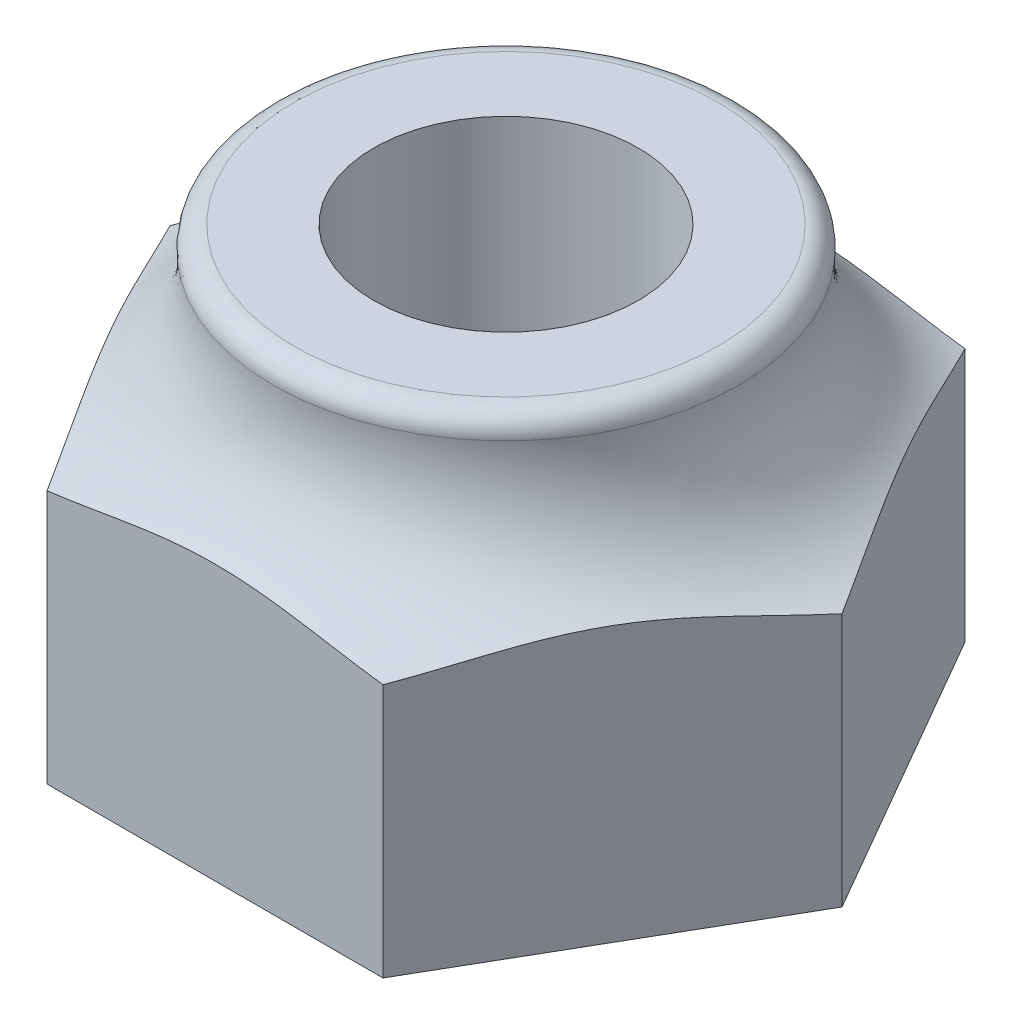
ISO-10303-21;
HEADER;
FILE_DESCRIPTION(('STEP AP214'),'2;1');
FILE_NAME('part.step','',(''),(''),'','','');
FILE_SCHEMA(('AUTOMOTIVE_DESIGN { 1 0 10303 214 1 1 1 1 }'));
ENDSEC;
DATA;
#1=APPLICATION_CONTEXT('core data for automotive mechanical design processes');
#2=APPLICATION_PROTOCOL_DEFINITION('international standard','automotive_design',2000,#1);
#3=PRODUCT_CONTEXT('',#1,'mechanical');
#4=PRODUCT('Part','Part','',(#3));
#5=PRODUCT_RELATED_PRODUCT_CATEGORY('part','',(#4));
#6=PRODUCT_DEFINITION_FORMATION('','',#4);
#7=PRODUCT_DEFINITION_CONTEXT('part definition',#1,'design');
#8=PRODUCT_DEFINITION('design','',#6,#7);
#9=PRODUCT_DEFINITION_SHAPE('','',#8);
#10=(LENGTH_UNIT() NAMED_UNIT(*) SI_UNIT(.MILLI.,.METRE.));
#11=(NAMED_UNIT(*) PLANE_ANGLE_UNIT() SI_UNIT($,.RADIAN.));
#12=(NAMED_UNIT(*) SI_UNIT($,.STERADIAN.) SOLID_ANGLE_UNIT());
#13=UNCERTAINTY_MEASURE_WITH_UNIT(LENGTH_MEASURE(1.E-05),#10,'distance_accuracy_value','');
#14=(GEOMETRIC_REPRESENTATION_CONTEXT(3) GLOBAL_UNCERTAINTY_ASSIGNED_CONTEXT((#13)) GLOBAL_UNIT_ASSIGNED_CONTEXT((#10,
#11,#12)) REPRESENTATION_CONTEXT('',''));
#15=CARTESIAN_POINT('',(0.,0.,0.));
#16=DIRECTION('',(0.,0.,1.));
#17=DIRECTION('',(1.,0.,0.));
#18=AXIS2_PLACEMENT_3D('',#15,#16,#17);
#19=CARTESIAN_POINT('',(3.17542648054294,4.,0.));
#20=DIRECTION('',(-0.866025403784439,0.,0.5));
#21=DIRECTION('',(0.5,0.,0.866025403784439));
#22=AXIS2_PLACEMENT_3D('',#19,#20,#21);
#23=PLANE('',#22);
#24=CARTESIAN_POINT('',(3.17554195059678,2.39997086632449,0.000199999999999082));
#25=CARTESIAN_POINT('',(3.1481533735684,2.40687781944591,-0.0472384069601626));
#26=CARTESIAN_POINT('',(3.12081137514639,2.41445945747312,-0.0945961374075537));
#27=CARTESIAN_POINT('',(3.06620121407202,2.43055422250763,-0.189183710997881));
#28=CARTESIAN_POINT('',(3.03893303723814,2.4390671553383,-0.23641357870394));
#29=CARTESIAN_POINT('',(2.95706841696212,2.4654213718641,-0.378207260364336));
#30=CARTESIAN_POINT('',(2.90253707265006,2.48404263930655,-0.472658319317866));
#31=CARTESIAN_POINT('',(2.79377304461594,2.51959863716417,-0.661043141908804));
#32=CARTESIAN_POINT('',(2.73954140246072,2.53654552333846,-0.754975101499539));
#33=CARTESIAN_POINT('',(2.63076214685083,2.5651452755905,-0.943386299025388));
#34=CARTESIAN_POINT('',(2.57621501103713,2.57680470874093,-1.03786470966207));
#35=CARTESIAN_POINT('',(2.49432193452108,2.58805878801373,-1.17970767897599));
#36=CARTESIAN_POINT('',(2.46708379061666,2.59077194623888,-1.22688552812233));
#37=CARTESIAN_POINT('',(2.41257422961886,2.59397083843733,-1.32129885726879));
#38=CARTESIAN_POINT('',(2.38530281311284,2.59445661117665,-1.3685343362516));
#39=CARTESIAN_POINT('',(2.33076554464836,2.59315671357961,-1.4629956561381));
#40=CARTESIAN_POINT('',(2.30349969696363,2.59137034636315,-1.51022148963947));
#41=CARTESIAN_POINT('',(2.2490226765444,2.58566437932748,-1.60457845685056));
#42=CARTESIAN_POINT('',(2.22181150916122,2.58174458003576,-1.65170958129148));
#43=CARTESIAN_POINT('',(2.14035527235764,2.56718904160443,-1.79279592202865));
#44=CARTESIAN_POINT('',(2.08623774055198,2.55375513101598,-1.88653023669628));
#45=CARTESIAN_POINT('',(1.97832043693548,2.52270727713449,-2.07344848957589));
#46=CARTESIAN_POINT('',(1.92452074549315,2.50509231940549,-2.16663228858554));
#47=CARTESIAN_POINT('',(1.84722603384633,2.4794001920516,-2.30051065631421));
#48=CARTESIAN_POINT('',(1.82371274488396,2.47153338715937,-2.34123686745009));
#49=CARTESIAN_POINT('',(1.77668077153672,2.45599045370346,-2.42269863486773));
#50=CARTESIAN_POINT('',(1.75316209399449,2.44831424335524,-2.46343417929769));
#51=CARTESIAN_POINT('',(1.70600983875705,2.43340582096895,-2.54510428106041));
#52=CARTESIAN_POINT('',(1.68237613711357,2.42617514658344,-2.58603905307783));
#53=CARTESIAN_POINT('',(1.63503905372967,2.41245070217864,-2.66802928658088));
#54=CARTESIAN_POINT('',(1.61133563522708,2.40595744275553,-2.70908481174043));
#55=CARTESIAN_POINT('',(1.58759777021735,2.39997086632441,-2.75020000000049));
#56=B_SPLINE_CURVE_WITH_KNOTS('',3,(#24,#25,#26,#27,#28,#29,#30,#31,#32,#33,#34,#35,#36,#37,#38,
#39,#40,#41,#42,#43,#44,#45,#46,#47,#48,#49,#50,#51,#52,#53,#54,#55),.UNSPECIFIED.,.F.,.F.,(4,2,
2,2,2,2,2,2,2,2,2,2,2,2,2,4),(0.,0.165617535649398,0.331200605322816,0.663125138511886,
0.992428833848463,1.32132240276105,1.48491237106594,1.64849949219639,1.81213679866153,
1.97578940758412,2.30279695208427,2.62988391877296,2.7729244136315,2.91590242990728,
3.05934905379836,3.20289440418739),.UNSPECIFIED.);
#57=CARTESIAN_POINT('',(3.17542648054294,2.4,0.));
#58=VERTEX_POINT('',#57);
#59=CARTESIAN_POINT('',(1.58771324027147,2.4,-2.75));
#60=VERTEX_POINT('',#59);
#61=EDGE_CURVE('E93',#58,#60,#56,.T.);
#62=ORIENTED_EDGE('',*,*,#61,.F.);
#63=DIRECTION('',(0.,-1.,0.));
#64=VECTOR('',#63,1.);
#65=CARTESIAN_POINT('',(3.17542648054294,4.,0.));
#66=LINE('',#65,#64);
#67=CARTESIAN_POINT('',(3.17542648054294,0.,0.));
#68=VERTEX_POINT('',#67);
#69=EDGE_CURVE('E64',#58,#68,#66,.T.);
#70=ORIENTED_EDGE('',*,*,#69,.T.);
#71=DIRECTION('',(-0.5,0.,-0.866025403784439));
#72=VECTOR('',#71,1.);
#73=CARTESIAN_POINT('',(3.17542648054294,0.,0.));
#74=LINE('',#73,#72);
#75=CARTESIAN_POINT('',(1.58771324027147,0.,-2.75));
#76=VERTEX_POINT('',#75);
#77=EDGE_CURVE('E99',#68,#76,#74,.T.);
#78=ORIENTED_EDGE('',*,*,#77,.T.);
#79=DIRECTION('',(0.,-1.,0.));
#80=VECTOR('',#79,1.);
#81=CARTESIAN_POINT('',(1.58771324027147,4.,-2.75));
#82=LINE('',#81,#80);
#83=EDGE_CURVE('E50',#60,#76,#82,.T.);
#84=ORIENTED_EDGE('',*,*,#83,.F.);
#85=EDGE_LOOP('',(#62,#70,#78,#84));
#86=FACE_BOUND('',#85,.T.);
#87=ADVANCED_FACE('F36',(#86),#23,.F.);
#88=CARTESIAN_POINT('',(1.58771324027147,4.,-2.75));
#89=DIRECTION('',(0.,0.,1.));
#90=DIRECTION('',(1.,0.,0.));
#91=AXIS2_PLACEMENT_3D('',#88,#89,#90);
#92=PLANE('',#91);
#93=CARTESIAN_POINT('',(0.,2.59408740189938,-2.75));
#94=CARTESIAN_POINT('',(-0.0541856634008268,2.59408927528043,-2.75));
#95=CARTESIAN_POINT('',(-0.108369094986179,2.59296330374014,-2.75));
#96=CARTESIAN_POINT('',(-0.216649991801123,2.58855378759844,-2.75));
#97=CARTESIAN_POINT('',(-0.270747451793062,2.5852701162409,-2.75));
#98=CARTESIAN_POINT('',(-0.432949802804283,2.5724927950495,-2.75));
#99=CARTESIAN_POINT('',(-0.540820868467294,2.56007380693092,-2.75));
#100=CARTESIAN_POINT('',(-0.757330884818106,2.53033233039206,-2.75));
#101=CARTESIAN_POINT('',(-0.86595997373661,2.51294471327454,-2.75));
#102=CARTESIAN_POINT('',(-1.0829899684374,2.47712238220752,-2.75));
#103=CARTESIAN_POINT('',(-1.19139095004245,2.45868810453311,-2.75));
#104=CARTESIAN_POINT('',(-1.40889170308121,2.42424281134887,-2.75));
#105=CARTESIAN_POINT('',(-1.51799255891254,2.40823822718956,-2.75));
#106=CARTESIAN_POINT('',(-1.73687116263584,2.38198345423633,-2.75));
#107=CARTESIAN_POINT('',(-1.8466484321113,2.37172958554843,-2.75));
#108=CARTESIAN_POINT('',(-2.065610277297,2.36011631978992,-2.75));
#109=CARTESIAN_POINT('',(-2.1747892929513,2.35866630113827,-2.75));
#110=CARTESIAN_POINT('',(-2.3926311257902,2.3673758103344,-2.75));
#111=CARTESIAN_POINT('',(-2.50129449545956,2.37751633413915,-2.75));
#112=CARTESIAN_POINT('',(-2.69556577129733,2.40890052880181,-2.75));
#113=CARTESIAN_POINT('',(-2.78157060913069,2.42761946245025,-2.75));
#114=CARTESIAN_POINT('',(-2.95075321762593,2.47595037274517,-2.75));
#115=CARTESIAN_POINT('',(-3.03392444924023,2.50558589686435,-2.75));
#116=CARTESIAN_POINT('',(-3.19565938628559,2.57722069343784,-2.75));
#117=CARTESIAN_POINT('',(-3.27418094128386,2.6193169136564,-2.75));
#118=CARTESIAN_POINT('',(-3.42275234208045,2.71644658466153,-2.75));
#119=CARTESIAN_POINT('',(-3.49281800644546,2.77145529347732,-2.75));
#120=CARTESIAN_POINT('',(-3.60628167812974,2.8801607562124,-2.75));
#121=CARTESIAN_POINT('',(-3.65212041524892,2.93130972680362,-2.75));
#122=CARTESIAN_POINT('',(-3.73475212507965,3.04050534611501,-2.75));
#123=CARTESIAN_POINT('',(-3.77154785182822,3.09854988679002,-2.75));
#124=CARTESIAN_POINT('',(-3.83446985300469,3.22061417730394,-2.75));
#125=CARTESIAN_POINT('',(-3.86053572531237,3.28466532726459,-2.75));
#126=CARTESIAN_POINT('',(-3.90019844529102,3.41652919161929,-2.75));
#127=CARTESIAN_POINT('',(-3.913801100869,3.48434013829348,-2.75));
#128=CARTESIAN_POINT('',(-3.92702930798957,3.61459455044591,-2.75));
#129=CARTESIAN_POINT('',(-3.92789108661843,3.67691479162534,-2.75));
#130=CARTESIAN_POINT('',(-3.91875902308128,3.80074017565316,-2.75));
#131=CARTESIAN_POINT('',(-3.90876819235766,3.86224553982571,-2.75));
#132=CARTESIAN_POINT('',(-3.87893475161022,3.98071232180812,-2.75));
#133=CARTESIAN_POINT('',(-3.85941539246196,4.03775603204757,-2.75));
#134=CARTESIAN_POINT('',(-3.81157047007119,4.14800818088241,-2.75));
#135=CARTESIAN_POINT('',(-3.78324313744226,4.20121584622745,-2.75));
#136=CARTESIAN_POINT('',(-3.71710182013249,4.30561429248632,-2.75));
#137=CARTESIAN_POINT('',(-3.67884261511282,4.35652171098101,-2.75));
#138=CARTESIAN_POINT('',(-3.59525205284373,4.45209986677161,-2.75));
#139=CARTESIAN_POINT('',(-3.5499199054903,4.49676990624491,-2.75));
#140=CARTESIAN_POINT('',(-3.44728541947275,4.58496870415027,-2.75));
#141=CARTESIAN_POINT('',(-3.38919289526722,4.62757488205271,-2.75));
#142=CARTESIAN_POINT('',(-3.26765241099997,4.70437481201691,-2.75));
#143=CARTESIAN_POINT('',(-3.20419650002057,4.73855576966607,-2.75));
#144=CARTESIAN_POINT('',(-3.03587675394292,4.81618852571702,-2.75));
#145=CARTESIAN_POINT('',(-2.92822827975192,4.85362739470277,-2.75));
#146=CARTESIAN_POINT('',(-2.70869627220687,4.91078934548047,-2.75));
#147=CARTESIAN_POINT('',(-2.5968154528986,4.93052358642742,-2.75));
#148=CARTESIAN_POINT('',(-2.28830937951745,4.96475112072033,-2.75));
#149=CARTESIAN_POINT('',(-2.09014180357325,4.9646011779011,-2.75));
#150=CARTESIAN_POINT('',(-1.7943361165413,4.94452553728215,-2.75));
#151=CARTESIAN_POINT('',(-1.69556674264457,4.93444113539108,-2.75));
#152=CARTESIAN_POINT('',(-1.49842807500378,4.90984125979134,-2.75));
#153=CARTESIAN_POINT('',(-1.40005938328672,4.89532062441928,-2.75));
#154=CARTESIAN_POINT('',(-1.20358450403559,4.86423328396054,-2.75));
#155=CARTESIAN_POINT('',(-1.1054786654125,4.84766460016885,-2.75));
#156=CARTESIAN_POINT('',(-0.909141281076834,4.81509048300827,-2.75));
#157=CARTESIAN_POINT('',(-0.810909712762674,4.79908517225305,-2.75));
#158=CARTESIAN_POINT('',(-0.61440073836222,4.77048072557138,-2.75));
#159=CARTESIAN_POINT('',(-0.516125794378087,4.75786567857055,-2.75));
#160=CARTESIAN_POINT('',(-0.319017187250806,4.73850989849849,-2.75));
#161=CARTESIAN_POINT('',(-0.220183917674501,4.73176544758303,-2.75));
#162=CARTESIAN_POINT('',(-0.0227076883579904,4.72573997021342,-2.75));
#163=CARTESIAN_POINT('',(0.0759341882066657,4.72642615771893,-2.75));
#164=CARTESIAN_POINT('',(0.272920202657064,4.73501520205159,-2.75));
#165=CARTESIAN_POINT('',(0.371264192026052,4.74292120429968,-2.75));
#166=CARTESIAN_POINT('',(0.567780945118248,4.76419403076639,-2.75));
#167=CARTESIAN_POINT('',(0.665950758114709,4.77758621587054,-2.75));
#168=CARTESIAN_POINT('',(0.861841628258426,4.80719567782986,-2.75));
#169=CARTESIAN_POINT('',(0.959562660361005,4.82341311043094,-2.75));
#170=CARTESIAN_POINT('',(1.14230957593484,4.85384849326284,-2.75));
#171=CARTESIAN_POINT('',(1.22733786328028,4.86805291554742,-2.75));
#172=CARTESIAN_POINT('',(1.39752905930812,4.8948511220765,-2.75));
#173=CARTESIAN_POINT('',(1.48269158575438,4.90744724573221,-2.75));
#174=CARTESIAN_POINT('',(1.65353046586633,4.92950158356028,-2.75));
#175=CARTESIAN_POINT('',(1.73920724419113,4.93895668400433,-2.75));
#176=CARTESIAN_POINT('',(1.91097434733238,4.95321465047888,-2.75));
#177=CARTESIAN_POINT('',(1.99706474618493,4.95801664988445,-2.75));
#178=CARTESIAN_POINT('',(2.2187119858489,4.96249991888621,-2.75));
#179=CARTESIAN_POINT('',(2.35442639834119,4.95768753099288,-2.75));
#180=CARTESIAN_POINT('',(2.62381259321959,4.9272464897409,-2.75));
#181=CARTESIAN_POINT('',(2.75748560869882,4.90163095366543,-2.75));
#182=CARTESIAN_POINT('',(2.97395669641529,4.83726104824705,-2.75));
#183=CARTESIAN_POINT('',(3.05888105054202,4.80571621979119,-2.75));
#184=CARTESIAN_POINT('',(3.22278972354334,4.72983919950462,-2.75));
#185=CARTESIAN_POINT('',(3.30178466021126,4.68553058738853,-2.75));
#186=CARTESIAN_POINT('',(3.43780766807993,4.5923127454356,-2.75));
#187=CARTESIAN_POINT('',(3.49627491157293,4.54551376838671,-2.75));
#188=CARTESIAN_POINT('',(3.60477519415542,4.44287767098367,-2.75));
#189=CARTESIAN_POINT('',(3.65480771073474,4.38703999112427,-2.75));
#190=CARTESIAN_POINT('',(3.74434813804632,4.2667273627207,-2.75));
#191=CARTESIAN_POINT('',(3.78377176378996,4.20218902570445,-2.75));
#192=CARTESIAN_POINT('',(3.84917474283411,4.0666152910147,-2.75));
#193=CARTESIAN_POINT('',(3.87516680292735,3.99558610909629,-2.75));
#194=CARTESIAN_POINT('',(3.90942102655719,3.85972932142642,-2.75));
#195=CARTESIAN_POINT('',(3.91962651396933,3.79538796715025,-2.75));
#196=CARTESIAN_POINT('',(3.92816490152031,3.66593155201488,-2.75));
#197=CARTESIAN_POINT('',(3.92650356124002,3.60081688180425,-2.75));
#198=CARTESIAN_POINT('',(3.91196314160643,3.47664152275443,-2.75));
#199=CARTESIAN_POINT('',(3.89990115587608,3.41748273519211,-2.75));
#200=CARTESIAN_POINT('',(3.86623721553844,3.3019617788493,-2.75));
#201=CARTESIAN_POINT('',(3.84463546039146,3.24559955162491,-2.75));
#202=CARTESIAN_POINT('',(3.7922240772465,3.13569820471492,-2.75));
#203=CARTESIAN_POINT('',(3.76120682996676,3.08225867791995,-2.75));
#204=CARTESIAN_POINT('',(3.69144039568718,2.98071829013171,-2.75));
#205=CARTESIAN_POINT('',(3.65268914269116,2.93261886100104,-2.75));
#206=CARTESIAN_POINT('',(3.56445089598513,2.83770151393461,-2.75));
#207=CARTESIAN_POINT('',(3.51426743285,2.79153328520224,-2.75));
#208=CARTESIAN_POINT('',(3.40787608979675,2.70678444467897,-2.75));
#209=CARTESIAN_POINT('',(3.35166382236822,2.66820941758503,-2.75));
#210=CARTESIAN_POINT('',(3.20612889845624,2.58154293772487,-2.75));
#211=CARTESIAN_POINT('',(3.11406781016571,2.53803625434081,-2.75));
#212=CARTESIAN_POINT('',(2.92419415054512,2.46646826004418,-2.75));
#213=CARTESIAN_POINT('',(2.82637394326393,2.4384279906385,-2.75));
#214=CARTESIAN_POINT('',(2.6513851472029,2.40082037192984,-2.75));
#215=CARTESIAN_POINT('',(2.57478656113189,2.38845605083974,-2.75));
#216=CARTESIAN_POINT('',(2.4207593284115,2.37054587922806,-2.75));
#217=CARTESIAN_POINT('',(2.34333010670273,2.3650051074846,-2.75));
#218=CARTESIAN_POINT('',(2.18794990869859,2.35969955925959,-2.75));
#219=CARTESIAN_POINT('',(2.1099981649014,2.35996128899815,-2.75));
#220=CARTESIAN_POINT('',(1.95432683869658,2.36524386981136,-2.75));
#221=CARTESIAN_POINT('',(1.87660713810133,2.37026161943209,-2.75));
#222=CARTESIAN_POINT('',(1.64776801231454,2.39050736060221,-2.75));
#223=CARTESIAN_POINT('',(1.49713594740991,2.41090724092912,-2.75));
#224=CARTESIAN_POINT('',(1.27181345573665,2.44575661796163,-2.75));
#225=CARTESIAN_POINT('',(1.19673208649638,2.45809646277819,-2.75));
#226=CARTESIAN_POINT('',(1.04660466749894,2.4830446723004,-2.75));
#227=CARTESIAN_POINT('',(0.971558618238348,2.49565304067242,-2.75));
#228=CARTESIAN_POINT('',(0.822159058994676,2.51979645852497,-2.75));
#229=CARTESIAN_POINT('',(0.747807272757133,2.53134200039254,-2.75));
#230=CARTESIAN_POINT('',(0.598808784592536,2.55231774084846,-2.75));
#231=CARTESIAN_POINT('',(0.52416214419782,2.56174835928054,-2.75));
#232=CARTESIAN_POINT('',(0.37470775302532,2.57736570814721,-2.75));
#233=CARTESIAN_POINT('',(0.299900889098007,2.58356059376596,-2.75));
#234=CARTESIAN_POINT('',(0.150061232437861,2.59191982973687,-2.75));
#235=CARTESIAN_POINT('',(0.0750284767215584,2.59408480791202,-2.75));
#236=CARTESIAN_POINT('',(0.,2.59408740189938,-2.75));
#237=B_SPLINE_CURVE_WITH_KNOTS('',3,(#93,#94,#95,#96,#97,#98,#99,#100,#101,#102,#103,#104,#105,
#106,#107,#108,#109,#110,#111,#112,#113,#114,#115,#116,#117,#118,#119,#120,#121,#122,#123,#124,
#125,#126,#127,#128,#129,#130,#131,#132,#133,#134,#135,#136,#137,#138,#139,#140,#141,#142,#143,
#144,#145,#146,#147,#148,#149,#150,#151,#152,#153,#154,#155,#156,#157,#158,#159,#160,#161,#162,
#163,#164,#165,#166,#167,#168,#169,#170,#171,#172,#173,#174,#175,#176,#177,#178,#179,#180,#181,
#182,#183,#184,#185,#186,#187,#188,#189,#190,#191,#192,#193,#194,#195,#196,#197,#198,#199,#200,
#201,#202,#203,#204,#205,#206,#207,#208,#209,#210,#211,#212,#213,#214,#215,#216,#217,#218,#219,
#220,#221,#222,#223,#224,#225,#226,#227,#228,#229,#230,#231,#232,#233,#234,#235,#236),
.UNSPECIFIED.,.T.,.F.,(4,2,2,2,2,2,2,2,2,2,2,2,2,2,2,2,2,2,2,2,2,2,2,2,2,2,2,2,2,2,2,2,2,2,2,2,
2,2,2,2,2,2,2,2,2,2,2,2,2,2,2,2,2,2,2,2,2,2,2,2,2,2,2,2,2,2,2,2,2,2,2,4),(0.,0.162542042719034,
0.325093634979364,0.650627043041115,0.980640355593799,1.31051710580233,1.6412523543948,
1.97177572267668,2.29889103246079,2.62547076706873,2.88893134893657,3.15296358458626,
3.41910662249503,3.68474380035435,3.88995738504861,4.09510839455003,4.30139897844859,
4.50759338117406,4.69363338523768,4.87962177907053,5.05969820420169,5.23981082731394,
5.43008985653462,5.62039015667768,5.83571578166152,6.05136640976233,6.39132138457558,
6.73106193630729,7.32180056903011,7.61966231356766,7.9178719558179,8.21637199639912,
8.51493660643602,8.81207451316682,9.10902410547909,9.404664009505,9.70043277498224,
9.99758449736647,10.2947526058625,10.5533713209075,10.8116094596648,11.0701028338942,
11.3286443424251,11.7349123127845,12.1409243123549,12.4118173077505,12.6822130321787,
12.9059901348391,13.1297810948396,13.3553007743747,13.5806067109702,13.7749995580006,
13.9692980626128,14.149593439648,14.3298850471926,14.5144832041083,14.6991307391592,
14.9029188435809,15.1068562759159,15.4106217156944,15.7147994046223,15.9472437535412,
16.1798610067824,16.4135410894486,16.6470688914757,17.1026839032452,17.330969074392,
17.5592573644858,17.7849735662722,18.0106449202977,18.2357447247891,18.4608094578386),.UNSPECIFIED.);
#238=CARTESIAN_POINT('',(-1.58771324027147,2.4,-2.75));
#239=VERTEX_POINT('',#238);
#240=EDGE_CURVE('E96',#60,#239,#237,.T.);
#241=ORIENTED_EDGE('',*,*,#240,.F.);
#242=ORIENTED_EDGE('',*,*,#83,.T.);
#243=DIRECTION('',(-1.,0.,0.));
#244=VECTOR('',#243,1.);
#245=CARTESIAN_POINT('',(1.58771324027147,0.,-2.75));
#246=LINE('',#245,#244);
#247=CARTESIAN_POINT('',(-1.58771324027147,0.,-2.75));
#248=VERTEX_POINT('',#247);
#249=EDGE_CURVE('E130',#76,#248,#246,.T.);
#250=ORIENTED_EDGE('',*,*,#249,.T.);
#251=DIRECTION('',(0.,-1.,0.));
#252=VECTOR('',#251,1.);
#253=CARTESIAN_POINT('',(-1.58771324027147,4.,-2.75));
#254=LINE('',#253,#252);
#255=EDGE_CURVE('E106',#239,#248,#254,.T.);
#256=ORIENTED_EDGE('',*,*,#255,.F.);
#257=EDGE_LOOP('',(#241,#242,#250,#256));
#258=FACE_BOUND('',#257,.T.);
#259=ADVANCED_FACE('F103',(#258),#92,.F.);
#260=CARTESIAN_POINT('',(-1.58771324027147,4.,-2.75));
#261=DIRECTION('',(0.866025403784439,0.,0.5));
#262=DIRECTION('',(0.5,0.,-0.866025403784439));
#263=AXIS2_PLACEMENT_3D('',#260,#261,#262);
#264=PLANE('',#263);
#265=CARTESIAN_POINT('',(-1.58759777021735,2.39997086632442,-2.75020000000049));
#266=CARTESIAN_POINT('',(-1.61498634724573,2.40687781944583,-2.70276159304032));
#267=CARTESIAN_POINT('',(-1.64232834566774,2.41445945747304,-2.65540386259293));
#268=CARTESIAN_POINT('',(-1.69693850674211,2.43055422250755,-2.56081628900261));
#269=CARTESIAN_POINT('',(-1.72420668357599,2.43906715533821,-2.51358642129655));
#270=CARTESIAN_POINT('',(-1.80607130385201,2.46542137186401,-2.37179273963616));
#271=CARTESIAN_POINT('',(-1.86060264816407,2.48404263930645,-2.27734168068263));
#272=CARTESIAN_POINT('',(-1.96936667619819,2.51959863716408,-2.08895685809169));
#273=CARTESIAN_POINT('',(-2.02359831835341,2.53654552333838,-1.99502489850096));
#274=CARTESIAN_POINT('',(-2.13237757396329,2.56514527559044,-1.80661370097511));
#275=CARTESIAN_POINT('',(-2.18692470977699,2.57680470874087,-1.71213529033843));
#276=CARTESIAN_POINT('',(-2.26881778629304,2.58805878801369,-1.57029232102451));
#277=CARTESIAN_POINT('',(-2.29605593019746,2.59077194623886,-1.52311447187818));
#278=CARTESIAN_POINT('',(-2.35056549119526,2.59397083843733,-1.42870114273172));
#279=CARTESIAN_POINT('',(-2.37783690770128,2.59445661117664,-1.38146566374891));
#280=CARTESIAN_POINT('',(-2.43237417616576,2.59315671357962,-1.28700434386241));
#281=CARTESIAN_POINT('',(-2.45964002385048,2.59137034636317,-1.23977851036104));
#282=CARTESIAN_POINT('',(-2.51411704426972,2.58566437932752,-1.14542154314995));
#283=CARTESIAN_POINT('',(-2.5413282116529,2.5817445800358,-1.09829041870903));
#284=CARTESIAN_POINT('',(-2.62278444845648,2.56718904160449,-0.957204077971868));
#285=CARTESIAN_POINT('',(-2.67690198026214,2.55375513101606,-0.863469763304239));
#286=CARTESIAN_POINT('',(-2.78481928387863,2.52270727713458,-0.676551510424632));
#287=CARTESIAN_POINT('',(-2.83861897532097,2.50509231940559,-0.583367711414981));
#288=CARTESIAN_POINT('',(-2.91591368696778,2.4794001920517,-0.449489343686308));
#289=CARTESIAN_POINT('',(-2.93942697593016,2.47153338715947,-0.408763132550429));
#290=CARTESIAN_POINT('',(-2.9864589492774,2.45599045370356,-0.327301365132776));
#291=CARTESIAN_POINT('',(-3.00997762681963,2.44831424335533,-0.286565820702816));
#292=CARTESIAN_POINT('',(-3.05712988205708,2.43340582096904,-0.204895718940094));
#293=CARTESIAN_POINT('',(-3.08076358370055,2.42617514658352,-0.163960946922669));
#294=CARTESIAN_POINT('',(-3.12810066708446,2.41245070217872,-0.0819707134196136));
#295=CARTESIAN_POINT('',(-3.15180408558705,2.4059574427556,-0.0409151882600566));
#296=CARTESIAN_POINT('',(-3.17554195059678,2.39997086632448,0.000199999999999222));
#297=B_SPLINE_CURVE_WITH_KNOTS('',3,(#265,#266,#267,#268,#269,#270,#271,#272,#273,#274,#275,
#276,#277,#278,#279,#280,#281,#282,#283,#284,#285,#286,#287,#288,#289,#290,#291,#292,#293,#294,
#295,#296),.UNSPECIFIED.,.F.,.F.,(4,2,2,2,2,2,2,2,2,2,2,2,2,2,2,4),(0.,0.165617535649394,
0.331200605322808,0.663125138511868,0.992428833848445,1.32132240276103,1.48491237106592,
1.64849949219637,1.8121367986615,1.97578940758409,2.30279695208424,2.62988391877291,
2.77292441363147,2.91590242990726,3.05934905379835,3.20289440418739),.UNSPECIFIED.);
#298=CARTESIAN_POINT('',(-3.17542648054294,2.4,0.));
#299=VERTEX_POINT('',#298);
#300=EDGE_CURVE('E107',#239,#299,#297,.T.);
#301=ORIENTED_EDGE('',*,*,#300,.F.);
#302=ORIENTED_EDGE('',*,*,#255,.T.);
#303=DIRECTION('',(-0.5,0.,0.866025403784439));
#304=VECTOR('',#303,1.);
#305=CARTESIAN_POINT('',(-1.58771324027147,0.,-2.75));
#306=LINE('',#305,#304);
#307=CARTESIAN_POINT('',(-3.17542648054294,0.,0.));
#308=VERTEX_POINT('',#307);
#309=EDGE_CURVE('E127',#248,#308,#306,.T.);
#310=ORIENTED_EDGE('',*,*,#309,.T.);
#311=DIRECTION('',(0.,-1.,0.));
#312=VECTOR('',#311,1.);
#313=CARTESIAN_POINT('',(-3.17542648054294,4.,0.));
#314=LINE('',#313,#312);
#315=EDGE_CURVE('E110',#299,#308,#314,.T.);
#316=ORIENTED_EDGE('',*,*,#315,.F.);
#317=EDGE_LOOP('',(#301,#302,#310,#316));
#318=FACE_BOUND('',#317,.T.);
#319=ADVANCED_FACE('F172',(#318),#264,.F.);
#320=CARTESIAN_POINT('',(-3.17542648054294,4.,0.));
#321=DIRECTION('',(0.866025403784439,0.,-0.5));
#322=DIRECTION('',(-0.5,0.,-0.866025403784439));
#323=AXIS2_PLACEMENT_3D('',#320,#321,#322);
#324=PLANE('',#323);
#325=CARTESIAN_POINT('',(-3.17554195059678,2.39997086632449,-0.000200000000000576));
#326=CARTESIAN_POINT('',(-3.1481533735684,2.40687781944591,0.0472384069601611));
#327=CARTESIAN_POINT('',(-3.12081137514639,2.41445945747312,0.0945961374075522));
#328=CARTESIAN_POINT('',(-3.06620121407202,2.43055422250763,0.189183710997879));
#329=CARTESIAN_POINT('',(-3.03893303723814,2.4390671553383,0.236413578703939));
#330=CARTESIAN_POINT('',(-2.95706841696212,2.4654213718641,0.378207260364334));
#331=CARTESIAN_POINT('',(-2.90253707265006,2.48404263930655,0.472658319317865));
#332=CARTESIAN_POINT('',(-2.79377304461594,2.51959863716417,0.661043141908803));
#333=CARTESIAN_POINT('',(-2.73954140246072,2.53654552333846,0.754975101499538));
#334=CARTESIAN_POINT('',(-2.63076214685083,2.5651452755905,0.943386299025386));
#335=CARTESIAN_POINT('',(-2.57621501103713,2.57680470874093,1.03786470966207));
#336=CARTESIAN_POINT('',(-2.49432193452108,2.58805878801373,1.17970767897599));
#337=CARTESIAN_POINT('',(-2.46708379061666,2.59077194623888,1.22688552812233));
#338=CARTESIAN_POINT('',(-2.41257422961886,2.59397083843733,1.32129885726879));
#339=CARTESIAN_POINT('',(-2.38530281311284,2.59445661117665,1.3685343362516));
#340=CARTESIAN_POINT('',(-2.33076554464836,2.59315671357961,1.46299565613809));
#341=CARTESIAN_POINT('',(-2.30349969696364,2.59137034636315,1.51022148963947));
#342=CARTESIAN_POINT('',(-2.2490226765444,2.58566437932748,1.60457845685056));
#343=CARTESIAN_POINT('',(-2.22181150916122,2.58174458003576,1.65170958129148));
#344=CARTESIAN_POINT('',(-2.14035527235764,2.56718904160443,1.79279592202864));
#345=CARTESIAN_POINT('',(-2.08623774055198,2.55375513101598,1.88653023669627));
#346=CARTESIAN_POINT('',(-1.97832043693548,2.52270727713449,2.07344848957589));
#347=CARTESIAN_POINT('',(-1.92452074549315,2.5050923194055,2.16663228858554));
#348=CARTESIAN_POINT('',(-1.84722603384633,2.4794001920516,2.30051065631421));
#349=CARTESIAN_POINT('',(-1.82371274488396,2.47153338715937,2.34123686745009));
#350=CARTESIAN_POINT('',(-1.77668077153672,2.45599045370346,2.42269863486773));
#351=CARTESIAN_POINT('',(-1.7531620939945,2.44831424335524,2.46343417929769));
#352=CARTESIAN_POINT('',(-1.70600983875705,2.43340582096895,2.54510428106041));
#353=CARTESIAN_POINT('',(-1.68237613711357,2.42617514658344,2.58603905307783));
#354=CARTESIAN_POINT('',(-1.63503905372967,2.41245070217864,2.66802928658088));
#355=CARTESIAN_POINT('',(-1.61133563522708,2.40595744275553,2.70908481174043));
#356=CARTESIAN_POINT('',(-1.58759777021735,2.39997086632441,2.75020000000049));
#357=B_SPLINE_CURVE_WITH_KNOTS('',3,(#325,#326,#327,#328,#329,#330,#331,#332,#333,#334,#335,
#336,#337,#338,#339,#340,#341,#342,#343,#344,#345,#346,#347,#348,#349,#350,#351,#352,#353,#354,
#355,#356),.UNSPECIFIED.,.F.,.F.,(4,2,2,2,2,2,2,2,2,2,2,2,2,2,2,4),(0.,0.165617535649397,
0.331200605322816,0.663125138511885,0.992428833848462,1.32132240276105,1.48491237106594,
1.64849949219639,1.81213679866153,1.97578940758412,2.30279695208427,2.62988391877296,
2.7729244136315,2.91590242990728,3.05934905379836,3.2028944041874),.UNSPECIFIED.);
#358=CARTESIAN_POINT('',(-1.58771324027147,2.4,2.75));
#359=VERTEX_POINT('',#358);
#360=EDGE_CURVE('E161',#299,#359,#357,.T.);
#361=ORIENTED_EDGE('',*,*,#360,.F.);
#362=ORIENTED_EDGE('',*,*,#315,.T.);
#363=DIRECTION('',(0.5,0.,0.866025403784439));
#364=VECTOR('',#363,1.);
#365=CARTESIAN_POINT('',(-3.17542648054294,0.,0.));
#366=LINE('',#365,#364);
#367=CARTESIAN_POINT('',(-1.58771324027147,0.,2.75));
#368=VERTEX_POINT('',#367);
#369=EDGE_CURVE('E124',#308,#368,#366,.T.);
#370=ORIENTED_EDGE('',*,*,#369,.T.);
#371=DIRECTION('',(0.,-1.,0.));
#372=VECTOR('',#371,1.);
#373=CARTESIAN_POINT('',(-1.58771324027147,4.,2.75));
#374=LINE('',#373,#372);
#375=EDGE_CURVE('E114',#359,#368,#374,.T.);
#376=ORIENTED_EDGE('',*,*,#375,.F.);
#377=EDGE_LOOP('',(#361,#362,#370,#376));
#378=FACE_BOUND('',#377,.T.);
#379=ADVANCED_FACE('F175',(#378),#324,.F.);
#380=CARTESIAN_POINT('',(-1.58771324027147,4.,2.75));
#381=DIRECTION('',(0.,0.,-1.));
#382=DIRECTION('',(-1.,0.,0.));
#383=AXIS2_PLACEMENT_3D('',#380,#381,#382);
#384=PLANE('',#383);
#385=CARTESIAN_POINT('',(0.,2.59408740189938,2.75));
#386=CARTESIAN_POINT('',(0.054185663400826,2.59408927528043,2.75));
#387=CARTESIAN_POINT('',(0.108369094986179,2.59296330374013,2.75));
#388=CARTESIAN_POINT('',(0.216649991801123,2.58855378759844,2.75));
#389=CARTESIAN_POINT('',(0.270747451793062,2.5852701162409,2.75));
#390=CARTESIAN_POINT('',(0.432949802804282,2.5724927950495,2.75));
#391=CARTESIAN_POINT('',(0.540820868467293,2.56007380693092,2.75));
#392=CARTESIAN_POINT('',(0.757330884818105,2.53033233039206,2.75));
#393=CARTESIAN_POINT('',(0.865959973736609,2.51294471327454,2.75));
#394=CARTESIAN_POINT('',(1.0829899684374,2.47712238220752,2.75));
#395=CARTESIAN_POINT('',(1.19139095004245,2.45868810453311,2.75));
#396=CARTESIAN_POINT('',(1.40889170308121,2.42424281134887,2.75));
#397=CARTESIAN_POINT('',(1.51799255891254,2.40823822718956,2.75));
#398=CARTESIAN_POINT('',(1.73687116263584,2.38198345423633,2.75));
#399=CARTESIAN_POINT('',(1.84664843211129,2.37172958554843,2.75));
#400=CARTESIAN_POINT('',(2.065610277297,2.36011631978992,2.75));
#401=CARTESIAN_POINT('',(2.1747892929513,2.35866630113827,2.75));
#402=CARTESIAN_POINT('',(2.3926311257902,2.3673758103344,2.75));
#403=CARTESIAN_POINT('',(2.50129449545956,2.37751633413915,2.75));
#404=CARTESIAN_POINT('',(2.69556577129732,2.40890052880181,2.75));
#405=CARTESIAN_POINT('',(2.78157060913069,2.42761946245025,2.75));
#406=CARTESIAN_POINT('',(2.95075321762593,2.47595037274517,2.75));
#407=CARTESIAN_POINT('',(3.03392444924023,2.50558589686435,2.75));
#408=CARTESIAN_POINT('',(3.19565938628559,2.57722069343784,2.75));
#409=CARTESIAN_POINT('',(3.27418094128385,2.61931691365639,2.75));
#410=CARTESIAN_POINT('',(3.42275234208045,2.71644658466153,2.75));
#411=CARTESIAN_POINT('',(3.49281800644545,2.77145529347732,2.75));
#412=CARTESIAN_POINT('',(3.60628167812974,2.8801607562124,2.75));
#413=CARTESIAN_POINT('',(3.65212041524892,2.93130972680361,2.75));
#414=CARTESIAN_POINT('',(3.73475212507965,3.04050534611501,2.75));
#415=CARTESIAN_POINT('',(3.77154785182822,3.09854988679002,2.75));
#416=CARTESIAN_POINT('',(3.83446985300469,3.22061417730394,2.75));
#417=CARTESIAN_POINT('',(3.86053572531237,3.28466532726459,2.75));
#418=CARTESIAN_POINT('',(3.90019844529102,3.41652919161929,2.75));
#419=CARTESIAN_POINT('',(3.913801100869,3.48434013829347,2.75));
#420=CARTESIAN_POINT('',(3.92702930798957,3.61459455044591,2.75));
#421=CARTESIAN_POINT('',(3.92789108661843,3.67691479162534,2.75));
#422=CARTESIAN_POINT('',(3.91875902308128,3.80074017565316,2.75));
#423=CARTESIAN_POINT('',(3.90876819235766,3.86224553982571,2.75));
#424=CARTESIAN_POINT('',(3.87893475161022,3.98071232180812,2.75));
#425=CARTESIAN_POINT('',(3.85941539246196,4.03775603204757,2.75));
#426=CARTESIAN_POINT('',(3.81157047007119,4.14800818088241,2.75));
#427=CARTESIAN_POINT('',(3.78324313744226,4.20121584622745,2.75));
#428=CARTESIAN_POINT('',(3.71710182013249,4.30561429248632,2.75));
#429=CARTESIAN_POINT('',(3.67884261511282,4.35652171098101,2.75));
#430=CARTESIAN_POINT('',(3.59525205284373,4.45209986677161,2.75));
#431=CARTESIAN_POINT('',(3.5499199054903,4.49676990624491,2.75));
#432=CARTESIAN_POINT('',(3.44728541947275,4.58496870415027,2.75));
#433=CARTESIAN_POINT('',(3.38919289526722,4.6275748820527,2.75));
#434=CARTESIAN_POINT('',(3.26765241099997,4.7043748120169,2.75));
#435=CARTESIAN_POINT('',(3.20419650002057,4.73855576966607,2.75));
#436=CARTESIAN_POINT('',(3.03587675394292,4.81618852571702,2.75));
#437=CARTESIAN_POINT('',(2.92822827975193,4.85362739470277,2.75));
#438=CARTESIAN_POINT('',(2.70869627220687,4.91078934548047,2.75));
#439=CARTESIAN_POINT('',(2.59681545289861,4.93052358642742,2.75));
#440=CARTESIAN_POINT('',(2.28830937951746,4.96475112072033,2.75));
#441=CARTESIAN_POINT('',(2.09014180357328,4.9646011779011,2.75));
#442=CARTESIAN_POINT('',(1.79433611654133,4.94452553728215,2.75));
#443=CARTESIAN_POINT('',(1.69556674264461,4.93444113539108,2.75));
#444=CARTESIAN_POINT('',(1.49842807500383,4.90984125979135,2.75));
#445=CARTESIAN_POINT('',(1.40005938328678,4.89532062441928,2.75));
#446=CARTESIAN_POINT('',(1.20358450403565,4.86423328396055,2.75));
#447=CARTESIAN_POINT('',(1.10547866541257,4.84766460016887,2.75));
#448=CARTESIAN_POINT('',(0.909141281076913,4.81509048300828,2.75));
#449=CARTESIAN_POINT('',(0.810909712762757,4.79908517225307,2.75));
#450=CARTESIAN_POINT('',(0.614400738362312,4.77048072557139,2.75));
#451=CARTESIAN_POINT('',(0.516125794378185,4.75786567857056,2.75));
#452=CARTESIAN_POINT('',(0.319017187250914,4.7385098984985,2.75));
#453=CARTESIAN_POINT('',(0.220183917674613,4.73176544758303,2.75));
#454=CARTESIAN_POINT('',(0.0227076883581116,4.72573997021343,2.75));
#455=CARTESIAN_POINT('',(-0.07593418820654,4.72642615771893,2.75));
#456=CARTESIAN_POINT('',(-0.272920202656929,4.73501520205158,2.75));
#457=CARTESIAN_POINT('',(-0.371264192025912,4.74292120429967,2.75));
#458=CARTESIAN_POINT('',(-0.567780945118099,4.76419403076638,2.75));
#459=CARTESIAN_POINT('',(-0.665950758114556,4.77758621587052,2.75));
#460=CARTESIAN_POINT('',(-0.861841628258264,4.80719567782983,2.75));
#461=CARTESIAN_POINT('',(-0.959562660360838,4.82341311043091,2.75));
#462=CARTESIAN_POINT('',(-1.14230957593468,4.85384849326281,2.75));
#463=CARTESIAN_POINT('',(-1.22733786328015,4.8680529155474,2.75));
#464=CARTESIAN_POINT('',(-1.39752905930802,4.89485112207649,2.75));
#465=CARTESIAN_POINT('',(-1.4826915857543,4.9074472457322,2.75));
#466=CARTESIAN_POINT('',(-1.65353046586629,4.92950158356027,2.75));
#467=CARTESIAN_POINT('',(-1.7392072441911,4.93895668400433,2.75));
#468=CARTESIAN_POINT('',(-1.91097434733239,4.95321465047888,2.75));
#469=CARTESIAN_POINT('',(-1.99706474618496,4.95801664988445,2.75));
#470=CARTESIAN_POINT('',(-2.21871198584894,4.9624999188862,2.75));
#471=CARTESIAN_POINT('',(-2.35442639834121,4.95768753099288,2.75));
#472=CARTESIAN_POINT('',(-2.62381259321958,4.9272464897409,2.75));
#473=CARTESIAN_POINT('',(-2.75748560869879,4.90163095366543,2.75));
#474=CARTESIAN_POINT('',(-2.97395669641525,4.83726104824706,2.75));
#475=CARTESIAN_POINT('',(-3.05888105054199,4.80571621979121,2.75));
#476=CARTESIAN_POINT('',(-3.22278972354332,4.72983919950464,2.75));
#477=CARTESIAN_POINT('',(-3.30178466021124,4.68553058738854,2.75));
#478=CARTESIAN_POINT('',(-3.43780766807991,4.59231274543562,2.75));
#479=CARTESIAN_POINT('',(-3.49627491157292,4.54551376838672,2.75));
#480=CARTESIAN_POINT('',(-3.6047751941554,4.44287767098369,2.75));
#481=CARTESIAN_POINT('',(-3.65480771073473,4.38703999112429,2.75));
#482=CARTESIAN_POINT('',(-3.74434813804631,4.26672736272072,2.75));
#483=CARTESIAN_POINT('',(-3.78377176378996,4.20218902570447,2.75));
#484=CARTESIAN_POINT('',(-3.8491747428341,4.06661529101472,2.75));
#485=CARTESIAN_POINT('',(-3.87516680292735,3.99558610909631,2.75));
#486=CARTESIAN_POINT('',(-3.90942102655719,3.85972932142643,2.75));
#487=CARTESIAN_POINT('',(-3.91962651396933,3.79538796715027,2.75));
#488=CARTESIAN_POINT('',(-3.92816490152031,3.66593155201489,2.75));
#489=CARTESIAN_POINT('',(-3.92650356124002,3.60081688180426,2.75));
#490=CARTESIAN_POINT('',(-3.91196314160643,3.47664152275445,2.75));
#491=CARTESIAN_POINT('',(-3.89990115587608,3.41748273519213,2.75));
#492=CARTESIAN_POINT('',(-3.86623721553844,3.30196177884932,2.75));
#493=CARTESIAN_POINT('',(-3.84463546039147,3.24559955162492,2.75));
#494=CARTESIAN_POINT('',(-3.7922240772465,3.13569820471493,2.75));
#495=CARTESIAN_POINT('',(-3.76120682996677,3.08225867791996,2.75));
#496=CARTESIAN_POINT('',(-3.69144039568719,2.98071829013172,2.75));
#497=CARTESIAN_POINT('',(-3.65268914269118,2.93261886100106,2.75));
#498=CARTESIAN_POINT('',(-3.56445089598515,2.83770151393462,2.75));
#499=CARTESIAN_POINT('',(-3.51426743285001,2.79153328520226,2.75));
#500=CARTESIAN_POINT('',(-3.40787608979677,2.70678444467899,2.75));
#501=CARTESIAN_POINT('',(-3.35166382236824,2.66820941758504,2.75));
#502=CARTESIAN_POINT('',(-3.20612889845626,2.58154293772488,2.75));
#503=CARTESIAN_POINT('',(-3.11406781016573,2.53803625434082,2.75));
#504=CARTESIAN_POINT('',(-2.92419415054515,2.46646826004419,2.75));
#505=CARTESIAN_POINT('',(-2.82637394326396,2.43842799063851,2.75));
#506=CARTESIAN_POINT('',(-2.65138514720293,2.40082037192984,2.75));
#507=CARTESIAN_POINT('',(-2.57478656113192,2.38845605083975,2.75));
#508=CARTESIAN_POINT('',(-2.42075932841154,2.37054587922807,2.75));
#509=CARTESIAN_POINT('',(-2.34333010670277,2.36500510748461,2.75));
#510=CARTESIAN_POINT('',(-2.18794990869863,2.35969955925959,2.75));
#511=CARTESIAN_POINT('',(-2.10999816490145,2.35996128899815,2.75));
#512=CARTESIAN_POINT('',(-1.95432683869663,2.36524386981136,2.75));
#513=CARTESIAN_POINT('',(-1.87660713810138,2.37026161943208,2.75));
#514=CARTESIAN_POINT('',(-1.64776801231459,2.3905073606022,2.75));
#515=CARTESIAN_POINT('',(-1.49713594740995,2.41090724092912,2.75));
#516=CARTESIAN_POINT('',(-1.27181345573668,2.44575661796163,2.75));
#517=CARTESIAN_POINT('',(-1.19673208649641,2.45809646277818,2.75));
#518=CARTESIAN_POINT('',(-1.04660466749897,2.4830446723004,2.75));
#519=CARTESIAN_POINT('',(-0.971558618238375,2.49565304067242,2.75));
#520=CARTESIAN_POINT('',(-0.8221590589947,2.51979645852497,2.75));
#521=CARTESIAN_POINT('',(-0.747807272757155,2.53134200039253,2.75));
#522=CARTESIAN_POINT('',(-0.598808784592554,2.55231774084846,2.75));
#523=CARTESIAN_POINT('',(-0.524162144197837,2.56174835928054,2.75));
#524=CARTESIAN_POINT('',(-0.374707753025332,2.5773657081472,2.75));
#525=CARTESIAN_POINT('',(-0.299900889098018,2.58356059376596,2.75));
#526=CARTESIAN_POINT('',(-0.150061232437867,2.59191982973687,2.75));
#527=CARTESIAN_POINT('',(-0.0750284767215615,2.59408480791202,2.75));
#528=CARTESIAN_POINT('',(0.,2.59408740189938,2.75));
#529=B_SPLINE_CURVE_WITH_KNOTS('',3,(#385,#386,#387,#388,#389,#390,#391,#392,#393,#394,#395,
#396,#397,#398,#399,#400,#401,#402,#403,#404,#405,#406,#407,#408,#409,#410,#411,#412,#413,#414,
#415,#416,#417,#418,#419,#420,#421,#422,#423,#424,#425,#426,#427,#428,#429,#430,#431,#432,#433,
#434,#435,#436,#437,#438,#439,#440,#441,#442,#443,#444,#445,#446,#447,#448,#449,#450,#451,#452,
#453,#454,#455,#456,#457,#458,#459,#460,#461,#462,#463,#464,#465,#466,#467,#468,#469,#470,#471,
#472,#473,#474,#475,#476,#477,#478,#479,#480,#481,#482,#483,#484,#485,#486,#487,#488,#489,#490,
#491,#492,#493,#494,#495,#496,#497,#498,#499,#500,#501,#502,#503,#504,#505,#506,#507,#508,#509,
#510,#511,#512,#513,#514,#515,#516,#517,#518,#519,#520,#521,#522,#523,#524,#525,#526,#527,#528),
.UNSPECIFIED.,.T.,.F.,(4,2,2,2,2,2,2,2,2,2,2,2,2,2,2,2,2,2,2,2,2,2,2,2,2,2,2,2,2,2,2,2,2,2,2,2,
2,2,2,2,2,2,2,2,2,2,2,2,2,2,2,2,2,2,2,2,2,2,2,2,2,2,2,2,2,2,2,2,2,2,2,4),(0.,0.162542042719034,
0.325093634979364,0.650627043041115,0.980640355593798,1.31051710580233,1.64125235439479,
1.97177572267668,2.29889103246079,2.62547076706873,2.88893134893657,3.15296358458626,
3.41910662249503,3.68474380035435,3.88995738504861,4.09510839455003,4.30139897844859,
4.50759338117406,4.69363338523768,4.87962177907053,5.05969820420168,5.23981082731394,
5.43008985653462,5.62039015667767,5.83571578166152,6.05136640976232,6.39132138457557,
6.73106193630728,7.32180056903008,7.61966231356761,7.91787195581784,8.21637199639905,
8.51493660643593,8.81207451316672,9.10902410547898,9.40466400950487,9.7004327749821,
9.99758449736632,10.2947526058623,10.5533713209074,10.8116094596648,11.0701028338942,
11.3286443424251,11.7349123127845,12.1409243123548,12.4118173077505,12.6822130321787,
12.9059901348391,13.1297810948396,13.3553007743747,13.5806067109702,13.7749995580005,
13.9692980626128,14.149593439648,14.3298850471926,14.5144832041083,14.6991307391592,
14.9029188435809,15.1068562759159,15.4106217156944,15.7147994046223,15.9472437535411,
16.1798610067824,16.4135410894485,16.6470688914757,17.1026839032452,17.330969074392,
17.5592573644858,17.7849735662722,18.0106449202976,18.2357447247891,18.4608094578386),.UNSPECIFIED.);
#530=CARTESIAN_POINT('',(1.58771324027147,2.4,2.75));
#531=VERTEX_POINT('',#530);
#532=EDGE_CURVE('E56',#359,#531,#529,.T.);
#533=ORIENTED_EDGE('',*,*,#532,.F.);
#534=ORIENTED_EDGE('',*,*,#375,.T.);
#535=DIRECTION('',(1.,0.,0.));
#536=VECTOR('',#535,1.);
#537=CARTESIAN_POINT('',(-1.58771324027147,0.,2.75));
#538=LINE('',#537,#536);
#539=CARTESIAN_POINT('',(1.58771324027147,0.,2.75));
#540=VERTEX_POINT('',#539);
#541=EDGE_CURVE('E121',#368,#540,#538,.T.);
#542=ORIENTED_EDGE('',*,*,#541,.T.);
#543=DIRECTION('',(0.,-1.,0.));
#544=VECTOR('',#543,1.);
#545=CARTESIAN_POINT('',(1.58771324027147,4.,2.75));
#546=LINE('',#545,#544);
#547=EDGE_CURVE('E116',#531,#540,#546,.T.);
#548=ORIENTED_EDGE('',*,*,#547,.F.);
#549=EDGE_LOOP('',(#533,#534,#542,#548));
#550=FACE_BOUND('',#549,.T.);
#551=ADVANCED_FACE('F205',(#550),#384,.F.);
#552=CARTESIAN_POINT('',(1.58771324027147,4.,2.75));
#553=DIRECTION('',(-0.866025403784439,0.,-0.5));
#554=DIRECTION('',(-0.5,0.,0.866025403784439));
#555=AXIS2_PLACEMENT_3D('',#552,#553,#554);
#556=PLANE('',#555);
#557=CARTESIAN_POINT('',(1.58759777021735,2.39997086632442,2.75020000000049));
#558=CARTESIAN_POINT('',(1.61498634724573,2.40687781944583,2.70276159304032));
#559=CARTESIAN_POINT('',(1.64232834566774,2.41445945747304,2.65540386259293));
#560=CARTESIAN_POINT('',(1.69693850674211,2.43055422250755,2.56081628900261));
#561=CARTESIAN_POINT('',(1.72420668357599,2.43906715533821,2.51358642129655));
#562=CARTESIAN_POINT('',(1.80607130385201,2.46542137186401,2.37179273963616));
#563=CARTESIAN_POINT('',(1.86060264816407,2.48404263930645,2.27734168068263));
#564=CARTESIAN_POINT('',(1.96936667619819,2.51959863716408,2.0889568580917));
#565=CARTESIAN_POINT('',(2.02359831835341,2.53654552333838,1.99502489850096));
#566=CARTESIAN_POINT('',(2.13237757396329,2.56514527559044,1.80661370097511));
#567=CARTESIAN_POINT('',(2.18692470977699,2.57680470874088,1.71213529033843));
#568=CARTESIAN_POINT('',(2.26881778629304,2.58805878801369,1.57029232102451));
#569=CARTESIAN_POINT('',(2.29605593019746,2.59077194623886,1.52311447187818));
#570=CARTESIAN_POINT('',(2.35056549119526,2.59397083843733,1.42870114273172));
#571=CARTESIAN_POINT('',(2.37783690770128,2.59445661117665,1.38146566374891));
#572=CARTESIAN_POINT('',(2.43237417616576,2.59315671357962,1.28700434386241));
#573=CARTESIAN_POINT('',(2.45964002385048,2.59137034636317,1.23977851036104));
#574=CARTESIAN_POINT('',(2.51411704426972,2.58566437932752,1.14542154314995));
#575=CARTESIAN_POINT('',(2.5413282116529,2.5817445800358,1.09829041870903));
#576=CARTESIAN_POINT('',(2.62278444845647,2.56718904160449,0.957204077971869));
#577=CARTESIAN_POINT('',(2.67690198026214,2.55375513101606,0.86346976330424));
#578=CARTESIAN_POINT('',(2.78481928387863,2.52270727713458,0.676551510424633));
#579=CARTESIAN_POINT('',(2.83861897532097,2.50509231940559,0.583367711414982));
#580=CARTESIAN_POINT('',(2.91591368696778,2.4794001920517,0.449489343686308));
#581=CARTESIAN_POINT('',(2.93942697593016,2.47153338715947,0.408763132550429));
#582=CARTESIAN_POINT('',(2.9864589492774,2.45599045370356,0.327301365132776));
#583=CARTESIAN_POINT('',(3.00997762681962,2.44831424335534,0.286565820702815));
#584=CARTESIAN_POINT('',(3.05712988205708,2.43340582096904,0.204895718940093));
#585=CARTESIAN_POINT('',(3.08076358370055,2.42617514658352,0.163960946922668));
#586=CARTESIAN_POINT('',(3.12810066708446,2.41245070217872,0.0819707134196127));
#587=CARTESIAN_POINT('',(3.15180408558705,2.4059574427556,0.0409151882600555));
#588=CARTESIAN_POINT('',(3.17554195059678,2.39997086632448,-0.000200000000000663));
#589=B_SPLINE_CURVE_WITH_KNOTS('',3,(#557,#558,#559,#560,#561,#562,#563,#564,#565,#566,#567,
#568,#569,#570,#571,#572,#573,#574,#575,#576,#577,#578,#579,#580,#581,#582,#583,#584,#585,#586,
#587,#588),.UNSPECIFIED.,.F.,.F.,(4,2,2,2,2,2,2,2,2,2,2,2,2,2,2,4),(0.,0.165617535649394,
0.331200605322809,0.663125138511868,0.992428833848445,1.32132240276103,1.48491237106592,
1.64849949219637,1.8121367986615,1.97578940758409,2.30279695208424,2.62988391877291,
2.77292441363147,2.91590242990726,3.05934905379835,3.2028944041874),.UNSPECIFIED.);
#590=EDGE_CURVE('E11',#531,#58,#589,.T.);
#591=ORIENTED_EDGE('',*,*,#590,.F.);
#592=ORIENTED_EDGE('',*,*,#547,.T.);
#593=DIRECTION('',(0.5,0.,-0.866025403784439));
#594=VECTOR('',#593,1.);
#595=CARTESIAN_POINT('',(1.58771324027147,0.,2.75));
#596=LINE('',#595,#594);
#597=EDGE_CURVE('E119',#540,#68,#596,.T.);
#598=ORIENTED_EDGE('',*,*,#597,.T.);
#599=ORIENTED_EDGE('',*,*,#69,.F.);
#600=EDGE_LOOP('',(#591,#592,#598,#599));
#601=FACE_BOUND('',#600,.T.);
#602=ADVANCED_FACE('F214',(#601),#556,.F.);
#603=CARTESIAN_POINT('',(0.,0.,0.));
#604=DIRECTION('',(0.,1.,0.));
#605=DIRECTION('',(0.,0.,1.));
#606=AXIS2_PLACEMENT_3D('',#603,#604,#605);
#607=PLANE('',#606);
#608=CARTESIAN_POINT('',(0.,0.,0.));
#609=DIRECTION('',(0.,1.,0.));
#610=DIRECTION('',(0.,0.,1.));
#611=AXIS2_PLACEMENT_3D('',#608,#609,#610);
#612=CIRCLE('',#611,1.25);
#613=CARTESIAN_POINT('',(0.,0.,1.25));
#614=VERTEX_POINT('',#613);
#615=EDGE_CURVE('E270',#614,#614,#612,.T.);
#616=ORIENTED_EDGE('',*,*,#615,.T.);
#617=EDGE_LOOP('',(#616));
#618=FACE_BOUND('',#617,.T.);
#619=ORIENTED_EDGE('',*,*,#77,.F.);
#620=ORIENTED_EDGE('',*,*,#597,.F.);
#621=ORIENTED_EDGE('',*,*,#541,.F.);
#622=ORIENTED_EDGE('',*,*,#369,.F.);
#623=ORIENTED_EDGE('',*,*,#309,.F.);
#624=ORIENTED_EDGE('',*,*,#249,.F.);
#625=EDGE_LOOP('',(#619,#620,#621,#622,#623,#624));
#626=FACE_BOUND('',#625,.T.);
#627=ADVANCED_FACE('F145',(#618,#626),#607,.F.);
#628=CARTESIAN_POINT('',(0.,3.66048818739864,0.));
#629=DIRECTION('',(0.,-1.,0.));
#630=DIRECTION('',(0.,0.,-1.));
#631=AXIS2_PLACEMENT_3D('',#628,#629,#630);
#632=TOROIDAL_SURFACE('',#631,3.49349805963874,1.3);
#633=CARTESIAN_POINT('',(0.,3.78139842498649,0.));
#634=DIRECTION('',(0.,-1.,0.));
#635=DIRECTION('',(0.,0.,-1.));
#636=AXIS2_PLACEMENT_3D('',#633,#634,#635);
#637=CIRCLE('',#636,2.1991330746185);
#638=CARTESIAN_POINT('',(0.,3.78139842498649,-2.1991330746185));
#639=VERTEX_POINT('',#638);
#640=EDGE_CURVE('E275',#639,#639,#637,.T.);
#641=ORIENTED_EDGE('',*,*,#640,.T.);
#642=EDGE_LOOP('',(#641));
#643=FACE_BOUND('',#642,.T.);
#644=ORIENTED_EDGE('',*,*,#61,.T.);
#645=ORIENTED_EDGE('',*,*,#240,.T.);
#646=ORIENTED_EDGE('',*,*,#300,.T.);
#647=ORIENTED_EDGE('',*,*,#360,.T.);
#648=ORIENTED_EDGE('',*,*,#532,.T.);
#649=ORIENTED_EDGE('',*,*,#590,.T.);
#650=EDGE_LOOP('',(#644,#645,#646,#647,#648,#649));
#651=FACE_BOUND('',#650,.T.);
#652=ADVANCED_FACE('F95',(#643,#651),#632,.F.);
#653=CARTESIAN_POINT('',(0.,3.8,0.));
#654=DIRECTION('',(0.,-1.,0.));
#655=DIRECTION('',(0.,0.,-1.));
#656=AXIS2_PLACEMENT_3D('',#653,#654,#655);
#657=TOROIDAL_SURFACE('',#656,2.,0.2);
#658=CARTESIAN_POINT('',(0.,4.,0.));
#659=DIRECTION('',(0.,-1.,0.));
#660=DIRECTION('',(0.,0.,-1.));
#661=AXIS2_PLACEMENT_3D('',#658,#659,#660);
#662=CIRCLE('',#661,2.);
#663=CARTESIAN_POINT('',(0.,4.,-2.));
#664=VERTEX_POINT('',#663);
#665=EDGE_CURVE('E279',#664,#664,#662,.T.);
#666=ORIENTED_EDGE('',*,*,#665,.T.);
#667=EDGE_LOOP('',(#666));
#668=FACE_BOUND('',#667,.T.);
#669=ORIENTED_EDGE('',*,*,#640,.F.);
#670=EDGE_LOOP('',(#669));
#671=FACE_BOUND('',#670,.T.);
#672=ADVANCED_FACE('F144',(#668,#671),#657,.T.);
#673=CARTESIAN_POINT('',(0.,4.,0.));
#674=DIRECTION('',(0.,1.,0.));
#675=DIRECTION('',(0.,0.,1.));
#676=AXIS2_PLACEMENT_3D('',#673,#674,#675);
#677=PLANE('',#676);
#678=CARTESIAN_POINT('',(0.,4.,0.));
#679=DIRECTION('',(0.,1.,0.));
#680=DIRECTION('',(0.,0.,1.));
#681=AXIS2_PLACEMENT_3D('',#678,#679,#680);
#682=CIRCLE('',#681,1.25);
#683=CARTESIAN_POINT('',(0.,4.,1.25));
#684=VERTEX_POINT('',#683);
#685=EDGE_CURVE('E273',#684,#684,#682,.T.);
#686=ORIENTED_EDGE('',*,*,#685,.F.);
#687=EDGE_LOOP('',(#686));
#688=FACE_BOUND('',#687,.T.);
#689=ORIENTED_EDGE('',*,*,#665,.F.);
#690=EDGE_LOOP('',(#689));
#691=FACE_BOUND('',#690,.T.);
#692=ADVANCED_FACE('F238',(#688,#691),#677,.T.);
#693=CARTESIAN_POINT('',(0.,4.,0.));
#694=DIRECTION('',(0.,1.,0.));
#695=DIRECTION('',(0.,0.,1.));
#696=AXIS2_PLACEMENT_3D('',#693,#694,#695);
#697=CYLINDRICAL_SURFACE('',#696,1.25);
#698=ORIENTED_EDGE('',*,*,#615,.F.);
#699=EDGE_LOOP('',(#698));
#700=FACE_BOUND('',#699,.T.);
#701=ORIENTED_EDGE('',*,*,#685,.T.);
#702=EDGE_LOOP('',(#701));
#703=FACE_BOUND('',#702,.T.);
#704=ADVANCED_FACE('F147',(#700,#703),#697,.F.);
#705=CLOSED_SHELL('',(#87,#259,#319,#379,#551,#602,#627,#652,#672,#692,#704));
#706=MANIFOLD_SOLID_BREP('B2',#705);
#707=ADVANCED_BREP_SHAPE_REPRESENTATION('',(#18,#706),#14);
#708=SHAPE_DEFINITION_REPRESENTATION(#9,#707);
ENDSEC;
END-ISO-10303-21;
